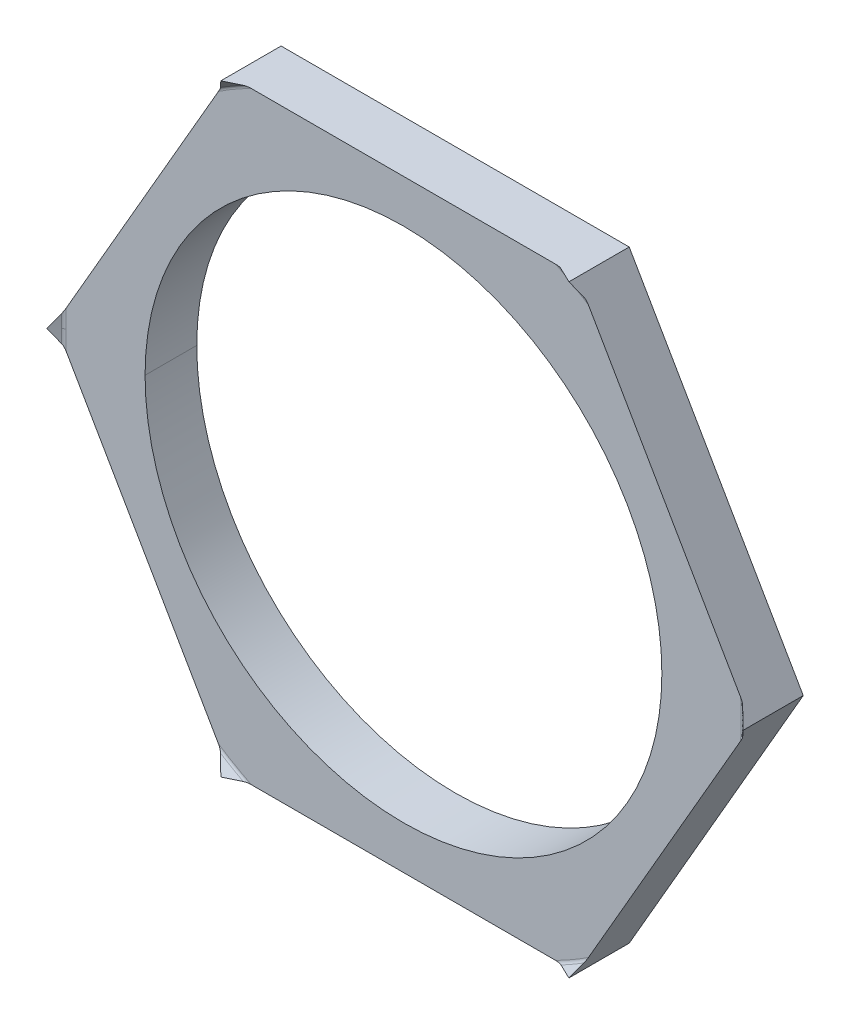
ISO-10303-21;
HEADER;
FILE_DESCRIPTION(('STEP AP214'),'2;1');
FILE_NAME('part.step','',(''),(''),'','','');
FILE_SCHEMA(('AUTOMOTIVE_DESIGN { 1 0 10303 214 1 1 1 1 }'));
ENDSEC;
DATA;
#1=APPLICATION_CONTEXT('core data for automotive mechanical design processes');
#2=APPLICATION_PROTOCOL_DEFINITION('international standard','automotive_design',2000,#1);
#3=PRODUCT_CONTEXT('',#1,'mechanical');
#4=PRODUCT('Part','Part','',(#3));
#5=PRODUCT_RELATED_PRODUCT_CATEGORY('part','',(#4));
#6=PRODUCT_DEFINITION_FORMATION('','',#4);
#7=PRODUCT_DEFINITION_CONTEXT('part definition',#1,'design');
#8=PRODUCT_DEFINITION('design','',#6,#7);
#9=PRODUCT_DEFINITION_SHAPE('','',#8);
#10=(LENGTH_UNIT() NAMED_UNIT(*) SI_UNIT(.MILLI.,.METRE.));
#11=(NAMED_UNIT(*) PLANE_ANGLE_UNIT() SI_UNIT($,.RADIAN.));
#12=(NAMED_UNIT(*) SI_UNIT($,.STERADIAN.) SOLID_ANGLE_UNIT());
#13=UNCERTAINTY_MEASURE_WITH_UNIT(LENGTH_MEASURE(1.E-05),#10,'distance_accuracy_value','');
#14=(GEOMETRIC_REPRESENTATION_CONTEXT(3) GLOBAL_UNCERTAINTY_ASSIGNED_CONTEXT((#13)) GLOBAL_UNIT_ASSIGNED_CONTEXT((#10,
#11,#12)) REPRESENTATION_CONTEXT('',''));
#15=CARTESIAN_POINT('',(0.,0.,0.));
#16=DIRECTION('',(0.,0.,1.));
#17=DIRECTION('',(1.,0.,0.));
#18=AXIS2_PLACEMENT_3D('',#15,#16,#17);
#19=CARTESIAN_POINT('',(39.2074120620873,0.,-8.));
#20=DIRECTION('',(0.,0.,1.));
#21=DIRECTION('',(0.,1.,0.));
#22=AXIS2_PLACEMENT_3D('',#19,#20,#21);
#23=PLANE('',#22);
#24=CARTESIAN_POINT('',(0.,0.,-8.));
#25=DIRECTION('',(0.,0.,-1.));
#26=DIRECTION('',(1.,0.,0.));
#27=AXIS2_PLACEMENT_3D('',#24,#25,#26);
#28=CIRCLE('',#27,30.);
#29=CARTESIAN_POINT('',(30.,0.,-8.));
#30=VERTEX_POINT('',#29);
#31=CARTESIAN_POINT('',(-30.,0.,-8.));
#32=VERTEX_POINT('',#31);
#33=EDGE_CURVE('E228',#30,#32,#28,.T.);
#34=ORIENTED_EDGE('',*,*,#33,.T.);
#35=CARTESIAN_POINT('',(0.,0.,-8.));
#36=DIRECTION('',(0.,0.,-1.));
#37=DIRECTION('',(1.,0.,0.));
#38=AXIS2_PLACEMENT_3D('',#35,#36,#37);
#39=CIRCLE('',#38,30.);
#40=EDGE_CURVE('E218',#32,#30,#39,.T.);
#41=ORIENTED_EDGE('',*,*,#40,.T.);
#42=EDGE_LOOP('',(#34,#41));
#43=FACE_BOUND('',#42,.T.);
#44=DIRECTION('',(0.5,-0.866025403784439,0.));
#45=VECTOR('',#44,1.);
#46=CARTESIAN_POINT('',(-40.4145188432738,0.,-8.));
#47=LINE('',#46,#45);
#48=CARTESIAN_POINT('',(-39.1457796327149,-2.19752077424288,-8.));
#49=VERTEX_POINT('',#48);
#50=CARTESIAN_POINT('',(-21.4759986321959,-32.8024792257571,-8.));
#51=VERTEX_POINT('',#50);
#52=EDGE_CURVE('E709',#49,#51,#47,.T.);
#53=ORIENTED_EDGE('',*,*,#52,.T.);
#54=CARTESIAN_POINT('',(0.,0.,-8.));
#55=DIRECTION('',(0.,0.,-1.));
#56=DIRECTION('',(-1.,0.,0.));
#57=AXIS2_PLACEMENT_3D('',#54,#55,#56);
#58=CIRCLE('',#57,39.2074120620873);
#59=CARTESIAN_POINT('',(-17.6697810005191,-35.,-8.));
#60=VERTEX_POINT('',#59);
#61=EDGE_CURVE('E604',#60,#51,#58,.T.);
#62=ORIENTED_EDGE('',*,*,#61,.F.);
#63=DIRECTION('',(1.,0.,0.));
#64=VECTOR('',#63,1.);
#65=CARTESIAN_POINT('',(-20.2072594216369,-35.,-8.));
#66=LINE('',#65,#64);
#67=CARTESIAN_POINT('',(17.6697810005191,-35.,-8.));
#68=VERTEX_POINT('',#67);
#69=EDGE_CURVE('E622',#60,#68,#66,.T.);
#70=ORIENTED_EDGE('',*,*,#69,.T.);
#71=CARTESIAN_POINT('',(0.,0.,-8.));
#72=DIRECTION('',(0.,0.,-1.));
#73=DIRECTION('',(-1.,0.,0.));
#74=AXIS2_PLACEMENT_3D('',#71,#72,#73);
#75=CIRCLE('',#74,39.2074120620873);
#76=CARTESIAN_POINT('',(21.4759986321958,-32.8024792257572,-8.));
#77=VERTEX_POINT('',#76);
#78=EDGE_CURVE('E563',#77,#68,#75,.T.);
#79=ORIENTED_EDGE('',*,*,#78,.F.);
#80=DIRECTION('',(0.5,0.866025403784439,0.));
#81=VECTOR('',#80,1.);
#82=CARTESIAN_POINT('',(20.2072594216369,-35.,-8.));
#83=LINE('',#82,#81);
#84=CARTESIAN_POINT('',(39.1457796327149,-2.19752077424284,-8.));
#85=VERTEX_POINT('',#84);
#86=EDGE_CURVE('E799',#77,#85,#83,.T.);
#87=ORIENTED_EDGE('',*,*,#86,.T.);
#88=CARTESIAN_POINT('',(0.,0.,-8.));
#89=DIRECTION('',(0.,0.,-1.));
#90=DIRECTION('',(-1.,0.,0.));
#91=AXIS2_PLACEMENT_3D('',#88,#89,#90);
#92=CIRCLE('',#91,39.2074120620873);
#93=CARTESIAN_POINT('',(39.1457796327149,2.19752077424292,-8.));
#94=VERTEX_POINT('',#93);
#95=EDGE_CURVE('E397',#94,#85,#92,.T.);
#96=ORIENTED_EDGE('',*,*,#95,.F.);
#97=DIRECTION('',(-0.5,0.866025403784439,0.));
#98=VECTOR('',#97,1.);
#99=CARTESIAN_POINT('',(40.4145188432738,0.,-8.));
#100=LINE('',#99,#98);
#101=CARTESIAN_POINT('',(21.4759986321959,32.8024792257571,-8.));
#102=VERTEX_POINT('',#101);
#103=EDGE_CURVE('E857',#94,#102,#100,.T.);
#104=ORIENTED_EDGE('',*,*,#103,.T.);
#105=CARTESIAN_POINT('',(0.,0.,-8.));
#106=DIRECTION('',(0.,0.,-1.));
#107=DIRECTION('',(-1.,0.,0.));
#108=AXIS2_PLACEMENT_3D('',#105,#106,#107);
#109=CIRCLE('',#108,39.2074120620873);
#110=CARTESIAN_POINT('',(17.669781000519,35.,-8.));
#111=VERTEX_POINT('',#110);
#112=EDGE_CURVE('E396',#111,#102,#109,.T.);
#113=ORIENTED_EDGE('',*,*,#112,.F.);
#114=DIRECTION('',(-1.,0.,0.));
#115=VECTOR('',#114,1.);
#116=CARTESIAN_POINT('',(20.2072594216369,35.,-8.));
#117=LINE('',#116,#115);
#118=CARTESIAN_POINT('',(-17.669781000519,35.,-8.));
#119=VERTEX_POINT('',#118);
#120=EDGE_CURVE('E415',#111,#119,#117,.T.);
#121=ORIENTED_EDGE('',*,*,#120,.T.);
#122=CARTESIAN_POINT('',(0.,0.,-8.));
#123=DIRECTION('',(0.,0.,-1.));
#124=DIRECTION('',(-1.,0.,0.));
#125=AXIS2_PLACEMENT_3D('',#122,#123,#124);
#126=CIRCLE('',#125,39.2074120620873);
#127=CARTESIAN_POINT('',(-21.4759986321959,32.8024792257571,-8.));
#128=VERTEX_POINT('',#127);
#129=EDGE_CURVE('E11',#128,#119,#126,.T.);
#130=ORIENTED_EDGE('',*,*,#129,.F.);
#131=DIRECTION('',(-0.5,-0.866025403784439,0.));
#132=VECTOR('',#131,1.);
#133=CARTESIAN_POINT('',(-20.2072594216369,35.,-8.));
#134=LINE('',#133,#132);
#135=CARTESIAN_POINT('',(-39.1457796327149,2.19752077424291,-8.));
#136=VERTEX_POINT('',#135);
#137=EDGE_CURVE('E452',#128,#136,#134,.T.);
#138=ORIENTED_EDGE('',*,*,#137,.T.);
#139=CARTESIAN_POINT('',(0.,0.,-8.));
#140=DIRECTION('',(0.,0.,-1.));
#141=DIRECTION('',(-1.,0.,0.));
#142=AXIS2_PLACEMENT_3D('',#139,#140,#141);
#143=CIRCLE('',#142,39.2074120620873);
#144=CARTESIAN_POINT('',(-39.2074120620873,0.,-8.));
#145=VERTEX_POINT('',#144);
#146=EDGE_CURVE('E239',#145,#136,#143,.T.);
#147=ORIENTED_EDGE('',*,*,#146,.F.);
#148=CARTESIAN_POINT('',(0.,0.,-8.));
#149=DIRECTION('',(0.,0.,-1.));
#150=DIRECTION('',(-1.,0.,0.));
#151=AXIS2_PLACEMENT_3D('',#148,#149,#150);
#152=CIRCLE('',#151,39.2074120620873);
#153=EDGE_CURVE('E605',#49,#145,#152,.T.);
#154=ORIENTED_EDGE('',*,*,#153,.F.);
#155=EDGE_LOOP('',(#53,#62,#70,#79,#87,#96,#104,#113,#121,#130,#138,#147,#154));
#156=FACE_BOUND('',#155,.T.);
#157=ADVANCED_FACE('F16',(#43,#156),#23,.T.);
#158=CARTESIAN_POINT('',(0.,0.,-7.));
#159=DIRECTION('',(0.,0.,1.));
#160=DIRECTION('',(1.,0.,0.));
#161=AXIS2_PLACEMENT_3D('',#158,#159,#160);
#162=CONICAL_SURFACE('',#161,40.4145188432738,0.785398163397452);
#163=CARTESIAN_POINT('',(-40.4145188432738,0.,-7.));
#164=CARTESIAN_POINT('',(-40.1218552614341,-0.506908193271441,-7.2926635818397));
#165=CARTESIAN_POINT('',(-39.827534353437,-1.01668695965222,-7.57745631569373));
#166=CARTESIAN_POINT('',(-39.5313824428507,-1.5296371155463,-7.85355339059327));
#167=(BOUNDED_CURVE() B_SPLINE_CURVE(3,(#163,#164,#165,#166),.UNSPECIFIED.,.F.,
.F.) B_SPLINE_CURVE_WITH_KNOTS((4,4),(0.0339504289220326,0.03591096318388),
.UNSPECIFIED.) CURVE() GEOMETRIC_REPRESENTATION_ITEM() RATIONAL_B_SPLINE_CURVE((1.,1.,1.,1.)) REPRESENTATION_ITEM(''));
#168=CARTESIAN_POINT('',(-40.4145188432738,0.,-7.));
#169=VERTEX_POINT('',#168);
#170=CARTESIAN_POINT('',(-39.5313824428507,-1.5296371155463,-7.85355339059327));
#171=VERTEX_POINT('',#170);
#172=EDGE_CURVE('E259',#169,#171,#167,.T.);
#173=ORIENTED_EDGE('',*,*,#172,.T.);
#174=CARTESIAN_POINT('',(0.,0.,-7.85355339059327));
#175=DIRECTION('',(0.,0.,-1.));
#176=DIRECTION('',(-1.,0.,0.));
#177=AXIS2_PLACEMENT_3D('',#174,#175,#176);
#178=CIRCLE('',#177,39.5609654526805);
#179=CARTESIAN_POINT('',(-39.5609654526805,0.,-7.85355339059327));
#180=VERTEX_POINT('',#179);
#181=EDGE_CURVE('E282',#171,#180,#178,.T.);
#182=ORIENTED_EDGE('',*,*,#181,.T.);
#183=CARTESIAN_POINT('',(0.,0.,-7.85355339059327));
#184=DIRECTION('',(0.,0.,-1.));
#185=DIRECTION('',(-1.,0.,0.));
#186=AXIS2_PLACEMENT_3D('',#183,#184,#185);
#187=CIRCLE('',#186,39.5609654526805);
#188=CARTESIAN_POINT('',(-39.5313824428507,1.52963711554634,-7.85355339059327));
#189=VERTEX_POINT('',#188);
#190=EDGE_CURVE('E253',#180,#189,#187,.T.);
#191=ORIENTED_EDGE('',*,*,#190,.T.);
#192=CARTESIAN_POINT('',(-39.5313824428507,1.52963711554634,-7.85355339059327));
#193=CARTESIAN_POINT('',(-39.828200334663,1.01553344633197,-7.57683543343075));
#194=CARTESIAN_POINT('',(-40.1224891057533,0.505810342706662,-7.29202973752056));
#195=CARTESIAN_POINT('',(-40.4145188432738,0.,-7.));
#196=(BOUNDED_CURVE() B_SPLINE_CURVE(3,(#192,#193,#194,#195),.UNSPECIFIED.,.F.,
.F.) B_SPLINE_CURVE_WITH_KNOTS((4,4),(0.0741404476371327,0.0761081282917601),
.UNSPECIFIED.) CURVE() GEOMETRIC_REPRESENTATION_ITEM() RATIONAL_B_SPLINE_CURVE((1.,1.,1.,1.)) REPRESENTATION_ITEM(''));
#197=EDGE_CURVE('E316',#189,#169,#196,.T.);
#198=ORIENTED_EDGE('',*,*,#197,.T.);
#199=EDGE_LOOP('',(#173,#182,#191,#198));
#200=FACE_BOUND('',#199,.T.);
#201=ADVANCED_FACE('F677',(#200),#162,.F.);
#202=CARTESIAN_POINT('',(0.,0.,-7.));
#203=DIRECTION('',(0.,0.,1.));
#204=DIRECTION('',(1.,0.,0.));
#205=AXIS2_PLACEMENT_3D('',#202,#203,#204);
#206=CONICAL_SURFACE('',#205,40.4145188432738,0.785398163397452);
#207=CARTESIAN_POINT('',(-18.4409866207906,35.,-7.85355339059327));
#208=CARTESIAN_POINT('',(-19.0335659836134,35.,-7.57732787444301));
#209=CARTESIAN_POINT('',(-19.6221954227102,35.,-7.29253199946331));
#210=CARTESIAN_POINT('',(-20.2072594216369,35.,-7.));
#211=(BOUNDED_CURVE() B_SPLINE_CURVE(3,(#207,#208,#209,#210),.UNSPECIFIED.,.F.,
.F.) B_SPLINE_CURVE_WITH_KNOTS((4,4),(0.0692713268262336,0.0712344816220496),
.UNSPECIFIED.) CURVE() GEOMETRIC_REPRESENTATION_ITEM() RATIONAL_B_SPLINE_CURVE((1.,1.,1.,1.)) REPRESENTATION_ITEM(''));
#212=CARTESIAN_POINT('',(-18.4409866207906,35.,-7.85355339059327));
#213=VERTEX_POINT('',#212);
#214=CARTESIAN_POINT('',(-20.2072594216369,35.,-7.));
#215=VERTEX_POINT('',#214);
#216=EDGE_CURVE('E312',#213,#215,#211,.T.);
#217=ORIENTED_EDGE('',*,*,#216,.T.);
#218=CARTESIAN_POINT('',(-20.2072594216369,35.,-7.));
#219=CARTESIAN_POINT('',(-20.4999230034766,34.4930918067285,-7.29266358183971));
#220=CARTESIAN_POINT('',(-20.7942439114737,33.9833130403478,-7.57745631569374));
#221=CARTESIAN_POINT('',(-21.09039582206,33.4703628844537,-7.85355339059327));
#222=(BOUNDED_CURVE() B_SPLINE_CURVE(3,(#218,#219,#220,#221),.UNSPECIFIED.,.F.,
.F.) B_SPLINE_CURVE_WITH_KNOTS((4,4),(0.0339504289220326,0.03591096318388),
.UNSPECIFIED.) CURVE() GEOMETRIC_REPRESENTATION_ITEM() RATIONAL_B_SPLINE_CURVE((1.,1.,1.,1.)) REPRESENTATION_ITEM(''));
#223=CARTESIAN_POINT('',(-21.09039582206,33.4703628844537,-7.85355339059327));
#224=VERTEX_POINT('',#223);
#225=EDGE_CURVE('E317',#215,#224,#222,.T.);
#226=ORIENTED_EDGE('',*,*,#225,.T.);
#227=CARTESIAN_POINT('',(0.,0.,-7.85355339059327));
#228=DIRECTION('',(0.,0.,-1.));
#229=DIRECTION('',(-1.,0.,0.));
#230=AXIS2_PLACEMENT_3D('',#227,#228,#229);
#231=CIRCLE('',#230,39.5609654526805);
#232=EDGE_CURVE('E25',#224,#213,#231,.T.);
#233=ORIENTED_EDGE('',*,*,#232,.T.);
#234=EDGE_LOOP('',(#217,#226,#233));
#235=FACE_BOUND('',#234,.T.);
#236=ADVANCED_FACE('F432',(#235),#206,.F.);
#237=CARTESIAN_POINT('',(0.,0.,-7.));
#238=DIRECTION('',(0.,0.,1.));
#239=DIRECTION('',(1.,0.,0.));
#240=AXIS2_PLACEMENT_3D('',#237,#238,#239);
#241=CONICAL_SURFACE('',#240,40.4145188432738,0.785398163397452);
#242=CARTESIAN_POINT('',(21.09039582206,33.4703628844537,-7.85355339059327));
#243=CARTESIAN_POINT('',(20.7935779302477,33.984466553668,-7.57683543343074));
#244=CARTESIAN_POINT('',(20.4992891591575,34.4941896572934,-7.29202973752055));
#245=CARTESIAN_POINT('',(20.2072594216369,35.,-7.));
#246=(BOUNDED_CURVE() B_SPLINE_CURVE(3,(#242,#243,#244,#245),.UNSPECIFIED.,.F.,
.F.) B_SPLINE_CURVE_WITH_KNOTS((4,4),(0.0741404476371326,0.0761081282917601),
.UNSPECIFIED.) CURVE() GEOMETRIC_REPRESENTATION_ITEM() RATIONAL_B_SPLINE_CURVE((1.,1.,1.,1.)) REPRESENTATION_ITEM(''));
#247=CARTESIAN_POINT('',(21.09039582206,33.4703628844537,-7.85355339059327));
#248=VERTEX_POINT('',#247);
#249=CARTESIAN_POINT('',(20.2072594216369,35.,-7.));
#250=VERTEX_POINT('',#249);
#251=EDGE_CURVE('E302',#248,#250,#246,.T.);
#252=ORIENTED_EDGE('',*,*,#251,.T.);
#253=CARTESIAN_POINT('',(20.2072594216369,35.,-7.));
#254=CARTESIAN_POINT('',(19.623352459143,35.,-7.291953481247));
#255=CARTESIAN_POINT('',(19.0347834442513,35.,-7.57676036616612));
#256=CARTESIAN_POINT('',(18.4409866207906,35.,-7.85355339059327));
#257=(BOUNDED_CURVE() B_SPLINE_CURVE(3,(#253,#254,#255,#256),.UNSPECIFIED.,.F.,
.F.) B_SPLINE_CURVE_WITH_KNOTS((4,4),(0.0291489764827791,0.0310946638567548),
.UNSPECIFIED.) CURVE() GEOMETRIC_REPRESENTATION_ITEM() RATIONAL_B_SPLINE_CURVE((1.,1.,1.,1.)) REPRESENTATION_ITEM(''));
#258=CARTESIAN_POINT('',(18.4409866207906,35.,-7.85355339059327));
#259=VERTEX_POINT('',#258);
#260=EDGE_CURVE('E308',#250,#259,#257,.T.);
#261=ORIENTED_EDGE('',*,*,#260,.T.);
#262=CARTESIAN_POINT('',(0.,0.,-7.85355339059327));
#263=DIRECTION('',(0.,0.,-1.));
#264=DIRECTION('',(-1.,0.,0.));
#265=AXIS2_PLACEMENT_3D('',#262,#263,#264);
#266=CIRCLE('',#265,39.5609654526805);
#267=EDGE_CURVE('E388',#259,#248,#266,.T.);
#268=ORIENTED_EDGE('',*,*,#267,.T.);
#269=EDGE_LOOP('',(#252,#261,#268));
#270=FACE_BOUND('',#269,.T.);
#271=ADVANCED_FACE('F685',(#270),#241,.F.);
#272=CARTESIAN_POINT('',(0.,0.,-7.));
#273=DIRECTION('',(0.,0.,1.));
#274=DIRECTION('',(1.,0.,0.));
#275=AXIS2_PLACEMENT_3D('',#272,#273,#274);
#276=CONICAL_SURFACE('',#275,40.4145188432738,0.785398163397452);
#277=DIRECTION('',(0.70710678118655,0.,0.707106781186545));
#278=VECTOR('',#277,1.);
#279=CARTESIAN_POINT('',(40.4145188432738,0.,-7.));
#280=LINE('',#279,#278);
#281=CARTESIAN_POINT('',(39.5609654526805,0.,-7.85355339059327));
#282=VERTEX_POINT('',#281);
#283=CARTESIAN_POINT('',(40.4145188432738,0.,-7.));
#284=VERTEX_POINT('',#283);
#285=EDGE_CURVE('E241',#282,#284,#280,.T.);
#286=ORIENTED_EDGE('',*,*,#285,.F.);
#287=CARTESIAN_POINT('',(0.,0.,-7.85355339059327));
#288=DIRECTION('',(0.,0.,-1.));
#289=DIRECTION('',(-1.,0.,0.));
#290=AXIS2_PLACEMENT_3D('',#287,#288,#289);
#291=CIRCLE('',#290,39.5609654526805);
#292=CARTESIAN_POINT('',(39.5313824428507,-1.52963711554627,-7.85355339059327));
#293=VERTEX_POINT('',#292);
#294=EDGE_CURVE('E556',#282,#293,#291,.T.);
#295=ORIENTED_EDGE('',*,*,#294,.T.);
#296=CARTESIAN_POINT('',(39.5313824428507,-1.52963711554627,-7.85355339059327));
#297=CARTESIAN_POINT('',(39.828200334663,-1.01553344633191,-7.57683543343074));
#298=CARTESIAN_POINT('',(40.1224891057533,-0.505810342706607,-7.29202973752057));
#299=CARTESIAN_POINT('',(40.4145188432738,0.,-7.));
#300=(BOUNDED_CURVE() B_SPLINE_CURVE(3,(#296,#297,#298,#299),.UNSPECIFIED.,.F.,
.F.) B_SPLINE_CURVE_WITH_KNOTS((4,4),(0.0741404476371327,0.0761081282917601),
.UNSPECIFIED.) CURVE() GEOMETRIC_REPRESENTATION_ITEM() RATIONAL_B_SPLINE_CURVE((1.,1.,1.,1.)) REPRESENTATION_ITEM(''));
#301=EDGE_CURVE('E292',#293,#284,#300,.T.);
#302=ORIENTED_EDGE('',*,*,#301,.T.);
#303=EDGE_LOOP('',(#286,#295,#302));
#304=FACE_BOUND('',#303,.T.);
#305=ADVANCED_FACE('F869',(#304),#276,.F.);
#306=CARTESIAN_POINT('',(0.,0.,-7.));
#307=DIRECTION('',(0.,0.,1.));
#308=DIRECTION('',(1.,0.,0.));
#309=AXIS2_PLACEMENT_3D('',#306,#307,#308);
#310=CONICAL_SURFACE('',#309,40.4145188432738,0.785398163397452);
#311=CARTESIAN_POINT('',(18.4409866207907,-35.,-7.85355339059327));
#312=CARTESIAN_POINT('',(19.0335659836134,-35.,-7.57732787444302));
#313=CARTESIAN_POINT('',(19.6221954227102,-35.,-7.29253199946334));
#314=CARTESIAN_POINT('',(20.2072594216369,-35.,-7.));
#315=(BOUNDED_CURVE() B_SPLINE_CURVE(3,(#311,#312,#313,#314),.UNSPECIFIED.,.F.,
.F.) B_SPLINE_CURVE_WITH_KNOTS((4,4),(0.0692713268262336,0.0712344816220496),
.UNSPECIFIED.) CURVE() GEOMETRIC_REPRESENTATION_ITEM() RATIONAL_B_SPLINE_CURVE((1.,1.,1.,1.)) REPRESENTATION_ITEM(''));
#316=CARTESIAN_POINT('',(18.4409866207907,-35.,-7.85355339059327));
#317=VERTEX_POINT('',#316);
#318=CARTESIAN_POINT('',(20.2072594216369,-35.,-7.));
#319=VERTEX_POINT('',#318);
#320=EDGE_CURVE('E279',#317,#319,#315,.T.);
#321=ORIENTED_EDGE('',*,*,#320,.T.);
#322=CARTESIAN_POINT('',(20.2072594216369,-35.,-7.));
#323=CARTESIAN_POINT('',(20.4999230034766,-34.4930918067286,-7.29266358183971));
#324=CARTESIAN_POINT('',(20.7942439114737,-33.9833130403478,-7.57745631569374));
#325=CARTESIAN_POINT('',(21.09039582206,-33.4703628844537,-7.85355339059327));
#326=(BOUNDED_CURVE() B_SPLINE_CURVE(3,(#322,#323,#324,#325),.UNSPECIFIED.,.F.,
.F.) B_SPLINE_CURVE_WITH_KNOTS((4,4),(0.0339504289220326,0.0359109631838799),
.UNSPECIFIED.) CURVE() GEOMETRIC_REPRESENTATION_ITEM() RATIONAL_B_SPLINE_CURVE((1.,1.,1.,1.)) REPRESENTATION_ITEM(''));
#327=CARTESIAN_POINT('',(21.09039582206,-33.4703628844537,-7.85355339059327));
#328=VERTEX_POINT('',#327);
#329=EDGE_CURVE('E288',#319,#328,#326,.T.);
#330=ORIENTED_EDGE('',*,*,#329,.T.);
#331=CARTESIAN_POINT('',(0.,0.,-7.85355339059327));
#332=DIRECTION('',(0.,0.,-1.));
#333=DIRECTION('',(-1.,0.,0.));
#334=AXIS2_PLACEMENT_3D('',#331,#332,#333);
#335=CIRCLE('',#334,39.5609654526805);
#336=EDGE_CURVE('E534',#328,#317,#335,.T.);
#337=ORIENTED_EDGE('',*,*,#336,.T.);
#338=EDGE_LOOP('',(#321,#330,#337));
#339=FACE_BOUND('',#338,.T.);
#340=ADVANCED_FACE('F785',(#339),#310,.F.);
#341=CARTESIAN_POINT('',(0.,0.,-7.));
#342=DIRECTION('',(0.,0.,1.));
#343=DIRECTION('',(1.,0.,0.));
#344=AXIS2_PLACEMENT_3D('',#341,#342,#343);
#345=CONICAL_SURFACE('',#344,40.4145188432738,0.785398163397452);
#346=CARTESIAN_POINT('',(-21.09039582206,-33.4703628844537,-7.85355339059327));
#347=CARTESIAN_POINT('',(-20.7935779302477,-33.984466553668,-7.57683543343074));
#348=CARTESIAN_POINT('',(-20.4992891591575,-34.4941896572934,-7.29202973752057));
#349=CARTESIAN_POINT('',(-20.2072594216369,-35.,-7.));
#350=(BOUNDED_CURVE() B_SPLINE_CURVE(3,(#346,#347,#348,#349),.UNSPECIFIED.,.F.,
.F.) B_SPLINE_CURVE_WITH_KNOTS((4,4),(0.0741404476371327,0.0761081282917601),
.UNSPECIFIED.) CURVE() GEOMETRIC_REPRESENTATION_ITEM() RATIONAL_B_SPLINE_CURVE((1.,1.,1.,1.)) REPRESENTATION_ITEM(''));
#351=CARTESIAN_POINT('',(-21.09039582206,-33.4703628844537,-7.85355339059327));
#352=VERTEX_POINT('',#351);
#353=CARTESIAN_POINT('',(-20.2072594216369,-35.,-7.));
#354=VERTEX_POINT('',#353);
#355=EDGE_CURVE('E268',#352,#354,#350,.T.);
#356=ORIENTED_EDGE('',*,*,#355,.T.);
#357=CARTESIAN_POINT('',(-20.2072594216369,-35.,-7.));
#358=CARTESIAN_POINT('',(-19.623352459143,-35.,-7.29195348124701));
#359=CARTESIAN_POINT('',(-19.0347834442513,-35.,-7.57676036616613));
#360=CARTESIAN_POINT('',(-18.4409866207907,-35.,-7.85355339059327));
#361=(BOUNDED_CURVE() B_SPLINE_CURVE(3,(#357,#358,#359,#360),.UNSPECIFIED.,.F.,
.F.) B_SPLINE_CURVE_WITH_KNOTS((4,4),(0.029148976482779,0.0310946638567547),
.UNSPECIFIED.) CURVE() GEOMETRIC_REPRESENTATION_ITEM() RATIONAL_B_SPLINE_CURVE((1.,1.,1.,1.)) REPRESENTATION_ITEM(''));
#362=CARTESIAN_POINT('',(-18.4409866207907,-35.,-7.85355339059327));
#363=VERTEX_POINT('',#362);
#364=EDGE_CURVE('E275',#354,#363,#361,.T.);
#365=ORIENTED_EDGE('',*,*,#364,.T.);
#366=CARTESIAN_POINT('',(0.,0.,-7.85355339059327));
#367=DIRECTION('',(0.,0.,-1.));
#368=DIRECTION('',(-1.,0.,0.));
#369=AXIS2_PLACEMENT_3D('',#366,#367,#368);
#370=CIRCLE('',#369,39.5609654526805);
#371=EDGE_CURVE('E596',#363,#352,#370,.T.);
#372=ORIENTED_EDGE('',*,*,#371,.T.);
#373=EDGE_LOOP('',(#356,#365,#372));
#374=FACE_BOUND('',#373,.T.);
#375=ADVANCED_FACE('F336',(#374),#345,.F.);
#376=CARTESIAN_POINT('',(0.,0.,-7.5));
#377=DIRECTION('',(0.,0.,-1.));
#378=DIRECTION('',(-1.,0.,0.));
#379=AXIS2_PLACEMENT_3D('',#376,#377,#378);
#380=TOROIDAL_SURFACE('',#379,39.2074120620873,0.5);
#381=CARTESIAN_POINT('',(-17.6697810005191,35.,-8.));
#382=CARTESIAN_POINT('',(-17.7089152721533,35.0000069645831,-7.99999648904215));
#383=CARTESIAN_POINT('',(-17.7480528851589,35.0000438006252,-7.99906614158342));
#384=CARTESIAN_POINT('',(-17.822015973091,35.0001045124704,-7.99548305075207));
#385=CARTESIAN_POINT('',(-17.8568511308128,35.0001293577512,-7.99302695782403));
#386=CARTESIAN_POINT('',(-17.9221595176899,35.000122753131,-7.98692338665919));
#387=CARTESIAN_POINT('',(-17.9526495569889,35.0000977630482,-7.98345644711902));
#388=CARTESIAN_POINT('',(-18.0092531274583,35.0000385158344,-7.97579664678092));
#389=CARTESIAN_POINT('',(-18.0353890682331,35.0000060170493,-7.97177036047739));
#390=CARTESIAN_POINT('',(-18.0804832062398,34.9999955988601,-7.96389217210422));
#391=CARTESIAN_POINT('',(-18.0994840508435,35.0000053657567,-7.96028382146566));
#392=CARTESIAN_POINT('',(-18.1365817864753,35.0000253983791,-7.9526438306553));
#393=CARTESIAN_POINT('',(-18.1546835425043,35.0000356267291,-7.94863589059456));
#394=CARTESIAN_POINT('',(-18.1899751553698,35.0000548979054,-7.94023634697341));
#395=CARTESIAN_POINT('',(-18.2071707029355,35.0000639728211,-7.93586870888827));
#396=CARTESIAN_POINT('',(-18.2406439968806,35.000075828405,-7.92679012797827));
#397=CARTESIAN_POINT('',(-18.2569282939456,35.0000788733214,-7.92210339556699));
#398=CARTESIAN_POINT('',(-18.2885746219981,35.0000779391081,-7.91242554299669));
#399=CARTESIAN_POINT('',(-18.303944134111,35.0000742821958,-7.90745895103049));
#400=CARTESIAN_POINT('',(-18.3337575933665,35.0000614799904,-7.89725886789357));
#401=CARTESIAN_POINT('',(-18.3482100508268,35.0000526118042,-7.89205030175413));
#402=CARTESIAN_POINT('',(-18.3761881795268,35.0000330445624,-7.88140303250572));
#403=CARTESIAN_POINT('',(-18.3897234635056,35.0000224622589,-7.87598970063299));
#404=CARTESIAN_POINT('',(-18.4158642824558,35.0000064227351,-7.86496534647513));
#405=CARTESIAN_POINT('',(-18.4284808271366,35.0000007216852,-7.85938038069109));
#406=CARTESIAN_POINT('',(-18.4409866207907,35.,-7.85355339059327));
#407=B_SPLINE_CURVE_WITH_KNOTS('',3,(#381,#382,#383,#384,#385,#386,#387,#388,#389,#390,#391,
#392,#393,#394,#395,#396,#397,#398,#399,#400,#401,#402,#403,#404,#405,#406),.UNSPECIFIED.,.F.,
.F.,(4,2,2,2,2,2,2,2,2,2,2,2,4),(0.,0.11739614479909,0.222126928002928,0.314160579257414,
0.39347319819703,0.451486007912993,0.507097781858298,0.560313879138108,0.611141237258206,
0.659588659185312,0.705667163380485,0.749390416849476,0.79077527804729),.UNSPECIFIED.);
#408=EDGE_CURVE('E358',#119,#213,#407,.T.);
#409=ORIENTED_EDGE('',*,*,#408,.T.);
#410=ORIENTED_EDGE('',*,*,#232,.F.);
#411=CARTESIAN_POINT('',(-21.0903958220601,33.4703628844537,-7.85355339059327));
#412=CARTESIAN_POINT('',(-21.0966300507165,33.4595663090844,-7.85936243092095));
#413=CARTESIAN_POINT('',(-21.1029236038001,33.4486768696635,-7.86493092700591));
#414=CARTESIAN_POINT('',(-21.1159657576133,33.4261190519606,-7.8759231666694));
#415=CARTESIAN_POINT('',(-21.1227200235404,33.4144413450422,-7.88132109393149));
#416=CARTESIAN_POINT('',(-21.1366781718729,33.3903040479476,-7.89193869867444));
#417=CARTESIAN_POINT('',(-21.1438867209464,33.3778361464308,-7.89713323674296));
#418=CARTESIAN_POINT('',(-21.1587510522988,33.3521159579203,-7.90730677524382));
#419=CARTESIAN_POINT('',(-21.1664108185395,33.3388562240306,-7.91226107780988));
#420=CARTESIAN_POINT('',(-21.1821757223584,33.3115527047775,-7.92191623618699));
#421=CARTESIAN_POINT('',(-21.1902842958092,33.2975023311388,-7.92659278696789));
#422=CARTESIAN_POINT('',(-21.2069460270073,33.2686200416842,-7.93565328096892));
#423=CARTESIAN_POINT('',(-21.2155022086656,33.2537823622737,-7.94001323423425));
#424=CARTESIAN_POINT('',(-21.2330610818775,33.2233313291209,-7.9484000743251));
#425=CARTESIAN_POINT('',(-21.2420665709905,33.2077130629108,-7.95240321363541));
#426=CARTESIAN_POINT('',(-21.2605221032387,33.1757069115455,-7.96003671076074));
#427=CARTESIAN_POINT('',(-21.2699745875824,33.159314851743,-7.96364358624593));
#428=CARTESIAN_POINT('',(-21.2925285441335,33.1202704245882,-7.97155469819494));
#429=CARTESIAN_POINT('',(-21.3056629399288,33.0975864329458,-7.97560962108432));
#430=CARTESIAN_POINT('',(-21.3341066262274,33.0484402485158,-7.98332606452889));
#431=CARTESIAN_POINT('',(-21.3494257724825,33.021957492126,-7.98681926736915));
#432=CARTESIAN_POINT('',(-21.3822041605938,32.9651974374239,-7.99297052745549));
#433=CARTESIAN_POINT('',(-21.3996662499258,32.9349020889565,-7.995446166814));
#434=CARTESIAN_POINT('',(-21.4367409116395,32.8705642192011,-7.99905847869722));
#435=CARTESIAN_POINT('',(-21.4563575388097,32.8365126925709,-7.99999643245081));
#436=CARTESIAN_POINT('',(-21.4759986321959,32.8024792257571,-8.));
#437=B_SPLINE_CURVE_WITH_KNOTS('',3,(#411,#412,#413,#414,#415,#416,#417,#418,#419,#420,#421,
#422,#423,#424,#425,#426,#427,#428,#429,#430,#431,#432,#433,#434,#435,#436),.UNSPECIFIED.,.F.,
.F.,(4,2,2,2,2,2,2,2,2,2,2,2,4),(0.,0.0412572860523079,0.0848382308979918,0.130759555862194,
0.17903482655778,0.229674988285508,0.282688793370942,0.338083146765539,0.395863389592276,
0.475414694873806,0.567767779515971,0.672898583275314,0.790775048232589),.UNSPECIFIED.);
#438=EDGE_CURVE('E219',#224,#128,#437,.T.);
#439=ORIENTED_EDGE('',*,*,#438,.T.);
#440=ORIENTED_EDGE('',*,*,#129,.T.);
#441=EDGE_LOOP('',(#409,#410,#439,#440));
#442=FACE_BOUND('',#441,.T.);
#443=ADVANCED_FACE('F325',(#442),#380,.F.);
#444=CARTESIAN_POINT('',(0.,0.,-7.5));
#445=DIRECTION('',(0.,0.,-1.));
#446=DIRECTION('',(-1.,0.,0.));
#447=AXIS2_PLACEMENT_3D('',#444,#445,#446);
#448=TOROIDAL_SURFACE('',#447,39.2074120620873,0.5);
#449=CARTESIAN_POINT('',(21.4759986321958,32.8024792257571,-8.));
#450=CARTESIAN_POINT('',(21.4564619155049,32.8363316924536,-7.99999650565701));
#451=CARTESIAN_POINT('',(21.4369493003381,32.8702019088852,-7.99906847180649));
#452=CARTESIAN_POINT('',(21.4000652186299,32.9342079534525,-7.99549432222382));
#453=CARTESIAN_POINT('',(21.3826897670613,32.9643526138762,-7.99304427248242));
#454=CARTESIAN_POINT('',(21.3500674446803,33.0208429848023,-7.98695559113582));
#455=CARTESIAN_POINT('',(21.3348177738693,33.0472064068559,-7.98349696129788));
#456=CARTESIAN_POINT('',(21.3064948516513,33.0961451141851,-7.97585530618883));
#457=CARTESIAN_POINT('',(21.2934119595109,33.1187405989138,-7.97183835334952));
#458=CARTESIAN_POINT('',(21.2708560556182,33.1577878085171,-7.96397082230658));
#459=CARTESIAN_POINT('',(21.261351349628,33.1742700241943,-7.96036188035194));
#460=CARTESIAN_POINT('',(21.2427953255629,33.206450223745,-7.95271958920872));
#461=CARTESIAN_POINT('',(21.2337415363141,33.2221524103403,-7.94871001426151));
#462=CARTESIAN_POINT('',(21.2160898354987,33.2527647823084,-7.94030623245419));
#463=CARTESIAN_POINT('',(21.2074891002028,33.2676799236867,-7.93593606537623));
#464=CARTESIAN_POINT('',(21.1907420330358,33.2967105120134,-7.92685159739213));
#465=CARTESIAN_POINT('',(21.1825926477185,33.3108317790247,-7.92216158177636));
#466=CARTESIAN_POINT('',(21.1667498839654,33.3382703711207,-7.91247646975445));
#467=CARTESIAN_POINT('',(21.1590530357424,33.3515943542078,-7.90750597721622));
#468=CARTESIAN_POINT('',(21.1441183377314,33.3774362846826,-7.89729752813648));
#469=CARTESIAN_POINT('',(21.1368764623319,33.389961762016,-7.89208457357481));
#470=CARTESIAN_POINT('',(21.122855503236,33.4142074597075,-7.88142808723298));
#471=CARTESIAN_POINT('',(21.1160717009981,33.4259360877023,-7.87601000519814));
#472=CARTESIAN_POINT('',(21.1029744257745,33.448589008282,-7.86497581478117));
#473=CARTESIAN_POINT('',(21.096655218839,33.4595227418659,-7.85938584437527));
#474=CARTESIAN_POINT('',(21.0903958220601,33.4703628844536,-7.85355339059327));
#475=B_SPLINE_CURVE_WITH_KNOTS('',3,(#449,#450,#451,#452,#453,#454,#455,#456,#457,#458,#459,
#460,#461,#462,#463,#464,#465,#466,#467,#468,#469,#470,#471,#472,#473,#474),.UNSPECIFIED.,.F.,
.F.,(4,2,2,2,2,2,2,2,2,2,2,2,4),(0.,0.117249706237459,0.221855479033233,0.313785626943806,
0.393016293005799,0.451104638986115,0.506786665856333,0.560067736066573,0.610954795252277,
0.659456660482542,0.705584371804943,0.749351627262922,0.79077532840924),.UNSPECIFIED.);
#476=EDGE_CURVE('E495',#102,#248,#475,.T.);
#477=ORIENTED_EDGE('',*,*,#476,.T.);
#478=ORIENTED_EDGE('',*,*,#267,.F.);
#479=CARTESIAN_POINT('',(18.4409866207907,35.,-7.85355339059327));
#480=CARTESIAN_POINT('',(18.4285175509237,35.0000007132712,-7.85936329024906));
#481=CARTESIAN_POINT('',(18.4159383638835,35.0000063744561,-7.86493257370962));
#482=CARTESIAN_POINT('',(18.3898775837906,35.0000223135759,-7.8759263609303));
#483=CARTESIAN_POINT('',(18.3763850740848,35.0000328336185,-7.8813250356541));
#484=CARTESIAN_POINT('',(18.3484978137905,35.0000523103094,-7.89194409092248));
#485=CARTESIAN_POINT('',(18.3340935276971,35.0000611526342,-7.89713931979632));
#486=CARTESIAN_POINT('',(18.3043817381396,35.0000739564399,-7.90731417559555));
#487=CARTESIAN_POINT('',(18.289065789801,35.000077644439,-7.91226909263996));
#488=CARTESIAN_POINT('',(18.2575318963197,35.0000786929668,-7.92192539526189));
#489=CARTESIAN_POINT('',(18.2413065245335,35.0000757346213,-7.92660246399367));
#490=CARTESIAN_POINT('',(18.2079563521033,35.000064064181,-7.93566388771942));
#491=CARTESIAN_POINT('',(18.1908250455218,35.00005508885,-7.94002424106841));
#492=CARTESIAN_POINT('',(18.155667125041,35.0000359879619,-7.94841175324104));
#493=CARTESIAN_POINT('',(18.1376348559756,35.00002582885,-7.95241515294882));
#494=CARTESIAN_POINT('',(18.1006812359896,35.0000057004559,-7.96004901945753));
#495=CARTESIAN_POINT('',(18.0817550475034,34.9999957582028,-7.96365599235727));
#496=CARTESIAN_POINT('',(18.0366646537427,35.0000058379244,-7.97156542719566));
#497=CARTESIAN_POINT('',(18.0104566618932,35.0000385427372,-7.97561887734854));
#498=CARTESIAN_POINT('',(17.9536823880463,35.000098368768,-7.9833324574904));
#499=CARTESIAN_POINT('',(17.923093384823,35.0001237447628,-7.98682434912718));
#500=CARTESIAN_POINT('',(17.8575603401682,35.0001306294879,-7.99297325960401));
#501=CARTESIAN_POINT('',(17.8225992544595,35.0001055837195,-7.99544794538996));
#502=CARTESIAN_POINT('',(17.7483578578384,35.0000442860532,-7.99905884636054));
#503=CARTESIAN_POINT('',(17.7090677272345,35.0000070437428,-7.99999643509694));
#504=CARTESIAN_POINT('',(17.669781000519,35.,-8.));
#505=B_SPLINE_CURVE_WITH_KNOTS('',3,(#479,#480,#481,#482,#483,#484,#485,#486,#487,#488,#489,
#490,#491,#492,#493,#494,#495,#496,#497,#498,#499,#500,#501,#502,#503,#504),.UNSPECIFIED.,.F.,
.F.,(4,2,2,2,2,2,2,2,2,2,2,2,4),(0.,0.0412633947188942,0.0848512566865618,0.130780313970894,
0.179064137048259,0.229713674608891,0.282737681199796,0.338143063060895,0.395935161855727,
0.475473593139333,0.567810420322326,0.672921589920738,0.790775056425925),.UNSPECIFIED.);
#506=EDGE_CURVE('E417',#259,#111,#505,.T.);
#507=ORIENTED_EDGE('',*,*,#506,.T.);
#508=ORIENTED_EDGE('',*,*,#112,.T.);
#509=EDGE_LOOP('',(#477,#478,#507,#508));
#510=FACE_BOUND('',#509,.T.);
#511=ADVANCED_FACE('F335',(#510),#448,.F.);
#512=CARTESIAN_POINT('',(0.,0.,-7.5));
#513=DIRECTION('',(0.,0.,-1.));
#514=DIRECTION('',(-1.,0.,0.));
#515=AXIS2_PLACEMENT_3D('',#512,#513,#514);
#516=TOROIDAL_SURFACE('',#515,39.2074120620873,0.5);
#517=CARTESIAN_POINT('',(39.1457796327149,-2.19752077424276,-8.));
#518=CARTESIAN_POINT('',(39.1653283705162,-2.16367524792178,-7.999996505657));
#519=CARTESIAN_POINT('',(39.1849045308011,-2.12984171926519,-7.99906847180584));
#520=CARTESIAN_POINT('',(39.2218933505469,-2.06589614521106,-7.99549432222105));
#521=CARTESIAN_POINT('',(39.23931166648,-2.03577623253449,-7.99304427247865));
#522=CARTESIAN_POINT('',(39.2719226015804,-1.97927928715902,-7.98695559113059));
#523=CARTESIAN_POINT('',(39.2871291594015,-1.95289097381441,-7.98349696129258));
#524=CARTESIAN_POINT('',(39.315349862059,-1.90389325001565,-7.97585530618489));
#525=CARTESIAN_POINT('',(39.3283766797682,-1.88126539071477,-7.97183835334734));
#526=CARTESIAN_POINT('',(39.350914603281,-1.84220780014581,-7.96397082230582));
#527=CARTESIAN_POINT('',(39.3604362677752,-1.82573537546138,-7.96036188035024));
#528=CARTESIAN_POINT('',(39.3790271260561,-1.79357528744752,-7.95271958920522));
#529=CARTESIAN_POINT('',(39.3880987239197,-1.77788338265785,-7.94871001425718));
#530=CARTESIAN_POINT('',(39.4057839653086,-1.74729037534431,-7.94030623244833));
#531=CARTESIAN_POINT('',(39.414400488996,-1.73238434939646,-7.9359360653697));
#532=CARTESIAN_POINT('',(39.4311681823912,-1.70336566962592,-7.92685159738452));
#533=CARTESIAN_POINT('',(39.4393228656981,-1.68924746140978,-7.92216158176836));
#534=CARTESIAN_POINT('',(39.4551640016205,-1.66180792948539,-7.91247646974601));
#535=CARTESIAN_POINT('',(39.4628544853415,-1.64848027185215,-7.90750597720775));
#536=CARTESIAN_POINT('',(39.4777669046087,-1.62262547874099,-7.89729752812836));
#537=CARTESIAN_POINT('',(39.4849933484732,-1.61009109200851,-7.89208457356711));
#538=CARTESIAN_POINT('',(39.4989802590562,-1.58582573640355,-7.88142808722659));
#539=CARTESIAN_POINT('',(39.5057456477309,-1.57408647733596,-7.87601000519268));
#540=CARTESIAN_POINT('',(39.5188150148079,-1.55141744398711,-7.8649758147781));
#541=CARTESIAN_POINT('',(39.5251243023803,-1.54047798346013,-7.85938584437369));
#542=CARTESIAN_POINT('',(39.5313824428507,-1.52963711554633,-7.85355339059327));
#543=B_SPLINE_CURVE_WITH_KNOTS('',3,(#517,#518,#519,#520,#521,#522,#523,#524,#525,#526,#527,
#528,#529,#530,#531,#532,#533,#534,#535,#536,#537,#538,#539,#540,#541,#542),.UNSPECIFIED.,.F.,
.F.,(4,2,2,2,2,2,2,2,2,2,2,2,4),(0.,0.11724970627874,0.221855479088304,0.31378562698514,
0.393016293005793,0.451104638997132,0.506786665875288,0.560067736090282,0.610954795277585,
0.659456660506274,0.705584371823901,0.749351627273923,0.790775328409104),.UNSPECIFIED.);
#544=EDGE_CURVE('E568',#85,#293,#543,.T.);
#545=ORIENTED_EDGE('',*,*,#544,.T.);
#546=ORIENTED_EDGE('',*,*,#294,.F.);
#547=CARTESIAN_POINT('',(0.,0.,-7.85355339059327));
#548=DIRECTION('',(0.,0.,-1.));
#549=DIRECTION('',(-1.,0.,0.));
#550=AXIS2_PLACEMENT_3D('',#547,#548,#549);
#551=CIRCLE('',#550,39.5609654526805);
#552=CARTESIAN_POINT('',(39.5313824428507,1.52963711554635,-7.85355339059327));
#553=VERTEX_POINT('',#552);
#554=EDGE_CURVE('E246',#553,#282,#551,.T.);
#555=ORIENTED_EDGE('',*,*,#554,.F.);
#556=CARTESIAN_POINT('',(39.5313824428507,1.52963711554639,-7.85355339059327));
#557=CARTESIAN_POINT('',(39.525149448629,1.54043440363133,-7.85936243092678));
#558=CARTESIAN_POINT('',(39.5188656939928,1.55132950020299,-7.86493092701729));
#559=CARTESIAN_POINT('',(39.505851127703,1.57390324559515,-7.87592316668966));
#560=CARTESIAN_POINT('',(39.4991150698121,1.58559146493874,-7.88132109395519));
#561=CARTESIAN_POINT('',(39.485190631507,1.60974822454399,-7.89193869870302));
#562=CARTESIAN_POINT('',(39.4779973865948,1.62222496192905,-7.89713323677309));
#563=CARTESIAN_POINT('',(39.4631552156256,1.64795794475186,-7.90730677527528));
#564=CARTESIAN_POINT('',(39.4555018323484,1.66122136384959,-7.91226107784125));
#565=CARTESIAN_POINT('',(39.4397387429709,1.68852593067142,-7.92191623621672));
#566=CARTESIAN_POINT('',(39.4316250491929,1.70257334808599,-7.92659278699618));
#567=CARTESIAN_POINT('',(39.4149431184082,1.73144397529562,-7.9356532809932));
#568=CARTESIAN_POINT('',(39.4063714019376,1.74627268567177,-7.94001323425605));
#569=CARTESIAN_POINT('',(39.3887794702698,1.77670463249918,-7.94840007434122));
#570=CARTESIAN_POINT('',(39.3797563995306,1.79231274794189,-7.95240321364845));
#571=CARTESIAN_POINT('',(39.3612660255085,1.8242987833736,-7.96003671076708));
#572=CARTESIAN_POINT('',(39.3517963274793,1.84068090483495,-7.96364358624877));
#573=CARTESIAN_POINT('',(39.3292598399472,1.87973541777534,-7.97155469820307));
#574=CARTESIAN_POINT('',(39.3161821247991,1.90245213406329,-7.97560962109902));
#575=CARTESIAN_POINT('',(39.2878421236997,1.95165818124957,-7.98332606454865));
#576=CARTESIAN_POINT('',(39.2725669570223,1.97816632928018,-7.98681926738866));
#577=CARTESIAN_POINT('',(39.2398005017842,2.03493327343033,-7.99297052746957));
#578=CARTESIAN_POINT('',(39.2222950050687,2.06520356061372,-7.99544616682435));
#579=CARTESIAN_POINT('',(39.1851141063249,2.12948009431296,-7.99905847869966));
#580=CARTESIAN_POINT('',(39.1654329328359,2.16349435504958,-7.99999643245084));
#581=CARTESIAN_POINT('',(39.1457796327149,2.19752077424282,-8.));
#582=B_SPLINE_CURVE_WITH_KNOTS('',3,(#556,#557,#558,#559,#560,#561,#562,#563,#564,#565,#566,
#567,#568,#569,#570,#571,#572,#573,#574,#575,#576,#577,#578,#579,#580,#581),.UNSPECIFIED.,.F.,
.F.,(4,2,2,2,2,2,2,2,2,2,2,2,4),(0.,0.0412572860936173,0.0848382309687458,0.130759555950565,
0.179034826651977,0.229674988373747,0.28268879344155,0.338083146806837,0.395863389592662,
0.475414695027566,0.567767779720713,0.672898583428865,0.790775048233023),.UNSPECIFIED.);
#583=EDGE_CURVE('E403',#553,#94,#582,.T.);
#584=ORIENTED_EDGE('',*,*,#583,.T.);
#585=ORIENTED_EDGE('',*,*,#95,.T.);
#586=EDGE_LOOP('',(#545,#546,#555,#584,#585));
#587=FACE_BOUND('',#586,.T.);
#588=ADVANCED_FACE('F470',(#587),#516,.F.);
#589=CARTESIAN_POINT('',(0.,0.,-7.5));
#590=DIRECTION('',(0.,0.,-1.));
#591=DIRECTION('',(-1.,0.,0.));
#592=AXIS2_PLACEMENT_3D('',#589,#590,#591);
#593=TOROIDAL_SURFACE('',#592,39.2074120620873,0.5);
#594=CARTESIAN_POINT('',(17.6697810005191,-35.,-8.));
#595=CARTESIAN_POINT('',(17.709096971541,-35.0000070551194,-7.99999642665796));
#596=CARTESIAN_POINT('',(17.7484163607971,-35.0000444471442,-7.99905744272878));
#597=CARTESIAN_POINT('',(17.8227151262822,-35.0001060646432,-7.9954409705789));
#598=CARTESIAN_POINT('',(17.8577043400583,-35.0001312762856,-7.992962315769));
#599=CARTESIAN_POINT('',(17.9232923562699,-35.000124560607,-7.98680315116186));
#600=CARTESIAN_POINT('',(17.9539082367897,-35.0000992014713,-7.98330518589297));
#601=CARTESIAN_POINT('',(18.0107349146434,-35.0000390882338,-7.97557763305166));
#602=CARTESIAN_POINT('',(18.0369684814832,-35.0000061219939,-7.97151649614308));
#603=CARTESIAN_POINT('',(18.0820637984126,-34.9999955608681,-7.96359858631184));
#604=CARTESIAN_POINT('',(18.1009696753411,-35.0000052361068,-7.95999250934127));
#605=CARTESIAN_POINT('',(18.13788455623,-35.0000249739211,-7.95236120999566));
#606=CARTESIAN_POINT('',(18.1558983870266,-35.0000350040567,-7.94835941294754));
#607=CARTESIAN_POINT('',(18.1910213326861,-35.0000539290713,-7.93997574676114));
#608=CARTESIAN_POINT('',(18.2081360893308,-35.0000628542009,-7.93561756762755));
#609=CARTESIAN_POINT('',(18.2414550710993,-35.000074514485,-7.92656097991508));
#610=CARTESIAN_POINT('',(18.2576657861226,-35.0000775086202,-7.92188650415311));
#611=CARTESIAN_POINT('',(18.2891722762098,-35.0000765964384,-7.91223573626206));
#612=CARTESIAN_POINT('',(18.3044754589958,-35.0000730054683,-7.90728369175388));
#613=CARTESIAN_POINT('',(18.3341636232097,-35.0000604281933,-7.89711479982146));
#614=CARTESIAN_POINT('',(18.3485570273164,-35.000051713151,-7.89192259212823));
#615=CARTESIAN_POINT('',(18.3764244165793,-35.0000324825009,-7.88130967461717));
#616=CARTESIAN_POINT('',(18.3899079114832,-35.0000220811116,-7.87591404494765));
#617=CARTESIAN_POINT('',(18.4159525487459,-35.0000063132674,-7.86492634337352));
#618=CARTESIAN_POINT('',(18.4285245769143,-35.0000007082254,-7.85936002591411));
#619=CARTESIAN_POINT('',(18.4409866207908,-35.,-7.85355339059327));
#620=B_SPLINE_CURVE_WITH_KNOTS('',3,(#594,#595,#596,#597,#598,#599,#600,#601,#602,#603,#604,
#605,#606,#607,#608,#609,#610,#611,#612,#613,#614,#615,#616,#617,#618,#619),.UNSPECIFIED.,.F.,
.F.,(4,2,2,2,2,2,2,2,2,2,2,2,4),(0.,0.117941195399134,0.22313729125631,0.315556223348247,
0.395173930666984,0.452905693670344,0.508256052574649,0.561230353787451,0.611835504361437,
0.660080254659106,0.705975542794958,0.749534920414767,0.790775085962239),.UNSPECIFIED.);
#621=EDGE_CURVE('E626',#68,#317,#620,.T.);
#622=ORIENTED_EDGE('',*,*,#621,.T.);
#623=ORIENTED_EDGE('',*,*,#336,.F.);
#624=CARTESIAN_POINT('',(21.09039582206,-33.4703628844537,-7.85355339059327));
#625=CARTESIAN_POINT('',(21.0966300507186,-33.4595663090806,-7.85936243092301));
#626=CARTESIAN_POINT('',(21.1029236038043,-33.4486768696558,-7.86493092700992));
#627=CARTESIAN_POINT('',(21.1159657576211,-33.4261190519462,-7.87592316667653));
#628=CARTESIAN_POINT('',(21.1227200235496,-33.4144413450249,-7.88132109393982));
#629=CARTESIAN_POINT('',(21.1366781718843,-33.3903040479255,-7.89193869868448));
#630=CARTESIAN_POINT('',(21.1438867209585,-33.3778361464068,-7.89713323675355));
#631=CARTESIAN_POINT('',(21.1587510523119,-33.3521159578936,-7.90730677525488));
#632=CARTESIAN_POINT('',(21.1664108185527,-33.3388562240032,-7.9122610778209));
#633=CARTESIAN_POINT('',(21.1821757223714,-33.3115527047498,-7.92191623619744));
#634=CARTESIAN_POINT('',(21.1902842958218,-33.2975023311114,-7.92659278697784));
#635=CARTESIAN_POINT('',(21.2069460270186,-33.268620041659,-7.93565328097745));
#636=CARTESIAN_POINT('',(21.215502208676,-33.2537823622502,-7.94001323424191));
#637=CARTESIAN_POINT('',(21.2330610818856,-33.223331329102,-7.94840007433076));
#638=CARTESIAN_POINT('',(21.2420665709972,-33.2077130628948,-7.95240321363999));
#639=CARTESIAN_POINT('',(21.2605221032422,-33.1757069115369,-7.96003671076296));
#640=CARTESIAN_POINT('',(21.2699745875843,-33.1593148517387,-7.96364358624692));
#641=CARTESIAN_POINT('',(21.2925285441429,-33.1202704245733,-7.97155469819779));
#642=CARTESIAN_POINT('',(21.3056629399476,-33.0975864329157,-7.97560962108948));
#643=CARTESIAN_POINT('',(21.3341066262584,-33.0484402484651,-7.98332606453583));
#644=CARTESIAN_POINT('',(21.3494257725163,-33.02195749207,-7.986819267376));
#645=CARTESIAN_POINT('',(21.3822041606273,-32.9651974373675,-7.99297052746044));
#646=CARTESIAN_POINT('',(21.3996662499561,-32.9349020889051,-7.99544616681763));
#647=CARTESIAN_POINT('',(21.4367409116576,-32.8705642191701,-7.99905847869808));
#648=CARTESIAN_POINT('',(21.4563575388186,-32.8365126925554,-7.99999643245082));
#649=CARTESIAN_POINT('',(21.4759986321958,-32.8024792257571,-8.));
#650=B_SPLINE_CURVE_WITH_KNOTS('',3,(#624,#625,#626,#627,#628,#629,#630,#631,#632,#633,#634,
#635,#636,#637,#638,#639,#640,#641,#642,#643,#644,#645,#646,#647,#648,#649),.UNSPECIFIED.,.F.,
.F.,(4,2,2,2,2,2,2,2,2,2,2,2,4),(0.,0.0412572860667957,0.0848382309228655,0.130759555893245,
0.179034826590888,0.229674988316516,0.282688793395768,0.338083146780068,0.395863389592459,
0.475414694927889,0.567767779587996,0.672898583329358,0.790775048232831),.UNSPECIFIED.);
#651=EDGE_CURVE('E298',#328,#77,#650,.T.);
#652=ORIENTED_EDGE('',*,*,#651,.T.);
#653=ORIENTED_EDGE('',*,*,#78,.T.);
#654=EDGE_LOOP('',(#622,#623,#652,#653));
#655=FACE_BOUND('',#654,.T.);
#656=ADVANCED_FACE('F474',(#655),#593,.F.);
#657=CARTESIAN_POINT('',(0.,0.,-7.5));
#658=DIRECTION('',(0.,0.,-1.));
#659=DIRECTION('',(-1.,0.,0.));
#660=AXIS2_PLACEMENT_3D('',#657,#658,#659);
#661=TOROIDAL_SURFACE('',#660,39.2074120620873,0.5);
#662=CARTESIAN_POINT('',(-21.4759986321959,-32.8024792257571,-8.));
#663=CARTESIAN_POINT('',(-21.4564619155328,-32.8363316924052,-7.99999650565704));
#664=CARTESIAN_POINT('',(-21.4369493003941,-32.8702019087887,-7.99906847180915));
#665=CARTESIAN_POINT('',(-21.4000652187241,-32.9342079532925,-7.99549432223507));
#666=CARTESIAN_POINT('',(-21.3826897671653,-32.9643526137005,-7.99304427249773));
#667=CARTESIAN_POINT('',(-21.3500674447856,-33.0208429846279,-7.98695559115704));
#668=CARTESIAN_POINT('',(-21.3348177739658,-33.0472064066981,-7.98349696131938));
#669=CARTESIAN_POINT('',(-21.3064948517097,-33.0961451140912,-7.97585530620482));
#670=CARTESIAN_POINT('',(-21.2934119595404,-33.1187405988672,-7.97183835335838));
#671=CARTESIAN_POINT('',(-21.2708560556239,-33.1577878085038,-7.96397082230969));
#672=CARTESIAN_POINT('',(-21.261351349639,-33.1742700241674,-7.96036188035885));
#673=CARTESIAN_POINT('',(-21.2427953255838,-33.2064502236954,-7.95271958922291));
#674=CARTESIAN_POINT('',(-21.2337415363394,-33.2221524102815,-7.94871001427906));
#675=CARTESIAN_POINT('',(-21.2160898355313,-33.2527647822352,-7.94030623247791));
#676=CARTESIAN_POINT('',(-21.2074891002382,-33.2676799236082,-7.93593606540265));
#677=CARTESIAN_POINT('',(-21.1907420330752,-33.2967105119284,-7.92685159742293));
#678=CARTESIAN_POINT('',(-21.1825926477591,-33.3108317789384,-7.92216158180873));
#679=CARTESIAN_POINT('',(-21.1667498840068,-33.3382703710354,-7.91247646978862));
#680=CARTESIAN_POINT('',(-21.1590530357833,-33.3515943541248,-7.9075059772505));
#681=CARTESIAN_POINT('',(-21.1441183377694,-33.3774362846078,-7.89729752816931));
#682=CARTESIAN_POINT('',(-21.1368764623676,-33.389961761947,-7.89208457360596));
#683=CARTESIAN_POINT('',(-21.1228555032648,-33.4142074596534,-7.88142808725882));
#684=CARTESIAN_POINT('',(-21.1160717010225,-33.4259360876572,-7.87601000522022));
#685=CARTESIAN_POINT('',(-21.1029744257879,-33.4485890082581,-7.86497581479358));
#686=CARTESIAN_POINT('',(-21.0966552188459,-33.4595227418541,-7.85938584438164));
#687=CARTESIAN_POINT('',(-21.0903958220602,-33.4703628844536,-7.85355339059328));
#688=B_SPLINE_CURVE_WITH_KNOTS('',3,(#662,#663,#664,#665,#666,#667,#668,#669,#670,#671,#672,
#673,#674,#675,#676,#677,#678,#679,#680,#681,#682,#683,#684,#685,#686,#687),.UNSPECIFIED.,.F.,
.F.,(4,2,2,2,2,2,2,2,2,2,2,2,4),(0.,0.117249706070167,0.221855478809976,0.313785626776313,
0.393016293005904,0.451104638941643,0.506786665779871,0.56006773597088,0.610954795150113,
0.659456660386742,0.70558437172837,0.749351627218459,0.790775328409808),.UNSPECIFIED.);
#689=EDGE_CURVE('E713',#51,#352,#688,.T.);
#690=ORIENTED_EDGE('',*,*,#689,.T.);
#691=ORIENTED_EDGE('',*,*,#371,.F.);
#692=CARTESIAN_POINT('',(-18.4409866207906,-35.,-7.85355339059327));
#693=CARTESIAN_POINT('',(-18.4285196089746,-35.0000007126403,-7.8593623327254));
#694=CARTESIAN_POINT('',(-18.415942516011,-35.0000063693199,-7.8649307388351));
#695=CARTESIAN_POINT('',(-18.3898862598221,-35.0000222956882,-7.87592280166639));
#696=CARTESIAN_POINT('',(-18.3763961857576,-35.0000328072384,-7.88132064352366));
#697=CARTESIAN_POINT('',(-18.3485141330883,-35.0000522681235,-7.89193808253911));
#698=CARTESIAN_POINT('',(-18.3341126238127,-35.0000611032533,-7.89713254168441));
#699=CARTESIAN_POINT('',(-18.3044067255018,-35.0000738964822,-7.90730592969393));
#700=CARTESIAN_POINT('',(-18.2890938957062,-35.0000775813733,-7.91226016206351));
#701=CARTESIAN_POINT('',(-18.2575665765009,-35.000078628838,-7.92191518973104));
#702=CARTESIAN_POINT('',(-18.2413446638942,-35.0000756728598,-7.92659168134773));
#703=CARTESIAN_POINT('',(-18.2080017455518,-35.0000640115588,-7.93565206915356));
#704=CARTESIAN_POINT('',(-18.1908742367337,-35.0000550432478,-7.94001197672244));
#705=CARTESIAN_POINT('',(-18.1557242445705,-35.0000359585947,-7.94839874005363));
#706=CARTESIAN_POINT('',(-18.1376961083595,-35.0000258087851,-7.95240184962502));
#707=CARTESIAN_POINT('',(-18.1007510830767,-35.0000056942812,-7.96003530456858));
#708=CARTESIAN_POINT('',(-18.0818293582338,-34.9999957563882,-7.96364216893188));
#709=CARTESIAN_POINT('',(-18.0367389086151,-35.0000058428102,-7.97155347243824));
#710=CARTESIAN_POINT('',(-18.0105263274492,-35.0000385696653,-7.97560856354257));
#711=CARTESIAN_POINT('',(-17.9537415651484,-35.0000984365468,-7.98332533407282));
#712=CARTESIAN_POINT('',(-17.9231466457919,-35.0001238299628,-7.9868186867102));
#713=CARTESIAN_POINT('',(-17.8576004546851,-35.0001307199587,-7.99297021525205));
#714=CARTESIAN_POINT('',(-17.8226321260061,-35.0001056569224,-7.9954459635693));
#715=CARTESIAN_POINT('',(-17.7483749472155,-35.0000443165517,-7.99905843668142));
#716=CARTESIAN_POINT('',(-17.709076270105,-35.0000070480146,-7.99999643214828));
#717=CARTESIAN_POINT('',(-17.6697810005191,-35.,-8.));
#718=B_SPLINE_CURVE_WITH_KNOTS('',3,(#692,#693,#694,#695,#696,#697,#698,#699,#700,#701,#702,
#703,#704,#705,#706,#707,#708,#709,#710,#711,#712,#713,#714,#715,#716,#717),.UNSPECIFIED.,.F.,
.F.,(4,2,2,2,2,2,2,2,2,2,2,2,4),(0.,0.0412565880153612,0.0848367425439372,0.130757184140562,
0.179031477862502,0.229670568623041,0.282683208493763,0.338076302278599,0.395855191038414,
0.475407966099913,0.567762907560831,0.672895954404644,0.790775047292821),.UNSPECIFIED.);
#719=EDGE_CURVE('E580',#363,#60,#718,.T.);
#720=ORIENTED_EDGE('',*,*,#719,.T.);
#721=ORIENTED_EDGE('',*,*,#61,.T.);
#722=EDGE_LOOP('',(#690,#691,#720,#721));
#723=FACE_BOUND('',#722,.T.);
#724=ADVANCED_FACE('F337',(#723),#661,.F.);
#725=CARTESIAN_POINT('',(0.,0.,-7.5));
#726=DIRECTION('',(0.,0.,-1.));
#727=DIRECTION('',(-1.,0.,0.));
#728=AXIS2_PLACEMENT_3D('',#725,#726,#727);
#729=TOROIDAL_SURFACE('',#728,39.2074120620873,0.5);
#730=CARTESIAN_POINT('',(-39.2074120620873,0.,-7.5));
#731=DIRECTION('',(0.,-1.,0.));
#732=DIRECTION('',(1.,0.,0.));
#733=AXIS2_PLACEMENT_3D('',#730,#731,#732);
#734=CIRCLE('',#733,0.5);
#735=EDGE_CURVE('E249',#180,#145,#734,.T.);
#736=ORIENTED_EDGE('',*,*,#735,.F.);
#737=ORIENTED_EDGE('',*,*,#181,.F.);
#738=CARTESIAN_POINT('',(-39.5313824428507,-1.52963711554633,-7.85355339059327));
#739=CARTESIAN_POINT('',(-39.5251494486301,-1.54043440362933,-7.85936243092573));
#740=CARTESIAN_POINT('',(-39.5188656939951,-1.55132950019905,-7.86493092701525));
#741=CARTESIAN_POINT('',(-39.5058511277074,-1.57390324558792,-7.87592316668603));
#742=CARTESIAN_POINT('',(-39.4991150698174,-1.58559146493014,-7.88132109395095));
#743=CARTESIAN_POINT('',(-39.4851906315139,-1.60974822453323,-7.8919386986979));
#744=CARTESIAN_POINT('',(-39.4779973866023,-1.62222496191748,-7.89713323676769));
#745=CARTESIAN_POINT('',(-39.4631552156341,-1.64795794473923,-7.90730677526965));
#746=CARTESIAN_POINT('',(-39.4555018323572,-1.6612213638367,-7.91226107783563));
#747=CARTESIAN_POINT('',(-39.4397387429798,-1.68852593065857,-7.92191623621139));
#748=CARTESIAN_POINT('',(-39.4316250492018,-1.70257334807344,-7.92659278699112));
#749=CARTESIAN_POINT('',(-39.4149431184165,-1.73144397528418,-7.93565328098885));
#750=CARTESIAN_POINT('',(-39.4063714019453,-1.74627268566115,-7.94001323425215));
#751=CARTESIAN_POINT('',(-39.3887794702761,-1.77670463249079,-7.94840007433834));
#752=CARTESIAN_POINT('',(-39.3797563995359,-1.79231274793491,-7.95240321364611));
#753=CARTESIAN_POINT('',(-39.3612660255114,-1.82429878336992,-7.96003671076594));
#754=CARTESIAN_POINT('',(-39.3517963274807,-1.84068090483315,-7.96364358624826));
#755=CARTESIAN_POINT('',(-39.3292598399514,-1.87973541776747,-7.97155469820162));
#756=CARTESIAN_POINT('',(-39.3161821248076,-1.90245213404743,-7.9756096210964));
#757=CARTESIAN_POINT('',(-39.2878421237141,-1.95165818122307,-7.98332606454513));
#758=CARTESIAN_POINT('',(-39.2725669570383,-1.97816632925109,-7.98681926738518));
#759=CARTESIAN_POINT('',(-39.2398005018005,-2.03493327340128,-7.99297052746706));
#760=CARTESIAN_POINT('',(-39.2222950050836,-2.06520356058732,-7.9954461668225));
#761=CARTESIAN_POINT('',(-39.185114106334,-2.12948009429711,-7.99905847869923));
#762=CARTESIAN_POINT('',(-39.1654329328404,-2.16349435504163,-7.99999643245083));
#763=CARTESIAN_POINT('',(-39.1457796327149,-2.19752077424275,-8.));
#764=B_SPLINE_CURVE_WITH_KNOTS('',3,(#738,#739,#740,#741,#742,#743,#744,#745,#746,#747,#748,
#749,#750,#751,#752,#753,#754,#755,#756,#757,#758,#759,#760,#761,#762,#763),.UNSPECIFIED.,.F.,
.F.,(4,2,2,2,2,2,2,2,2,2,2,2,4),(0.,0.041257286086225,0.0848382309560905,0.130759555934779,
0.179034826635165,0.229674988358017,0.282688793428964,0.338083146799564,0.395863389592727,
0.475414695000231,0.567767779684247,0.672898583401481,0.790775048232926),.UNSPECIFIED.);
#765=EDGE_CURVE('E610',#171,#49,#764,.T.);
#766=ORIENTED_EDGE('',*,*,#765,.T.);
#767=ORIENTED_EDGE('',*,*,#153,.T.);
#768=EDGE_LOOP('',(#736,#737,#766,#767));
#769=FACE_BOUND('',#768,.T.);
#770=ADVANCED_FACE('F669',(#769),#729,.F.);
#771=CARTESIAN_POINT('',(-20.2072594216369,-35.,-14.));
#772=DIRECTION('',(0.,0.,1.));
#773=DIRECTION('',(0.,1.,0.));
#774=AXIS2_PLACEMENT_3D('',#771,#772,#773);
#775=PLANE('',#774);
#776=CARTESIAN_POINT('',(0.,0.,-14.));
#777=DIRECTION('',(0.,0.,1.));
#778=DIRECTION('',(1.,0.,0.));
#779=AXIS2_PLACEMENT_3D('',#776,#777,#778);
#780=CIRCLE('',#779,30.);
#781=CARTESIAN_POINT('',(30.,0.,-14.));
#782=VERTEX_POINT('',#781);
#783=CARTESIAN_POINT('',(-30.,0.,-14.));
#784=VERTEX_POINT('',#783);
#785=EDGE_CURVE('E208',#782,#784,#780,.T.);
#786=ORIENTED_EDGE('',*,*,#785,.T.);
#787=CARTESIAN_POINT('',(0.,0.,-14.));
#788=DIRECTION('',(0.,0.,1.));
#789=DIRECTION('',(1.,0.,0.));
#790=AXIS2_PLACEMENT_3D('',#787,#788,#789);
#791=CIRCLE('',#790,30.);
#792=EDGE_CURVE('E213',#784,#782,#791,.T.);
#793=ORIENTED_EDGE('',*,*,#792,.T.);
#794=EDGE_LOOP('',(#786,#793));
#795=FACE_BOUND('',#794,.T.);
#796=DIRECTION('',(0.5,-0.866025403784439,0.));
#797=VECTOR('',#796,1.);
#798=CARTESIAN_POINT('',(-40.4145188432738,0.,-14.));
#799=LINE('',#798,#797);
#800=CARTESIAN_POINT('',(-40.4145188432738,0.,-14.));
#801=VERTEX_POINT('',#800);
#802=CARTESIAN_POINT('',(-20.2072594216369,-35.,-14.));
#803=VERTEX_POINT('',#802);
#804=EDGE_CURVE('E258',#801,#803,#799,.T.);
#805=ORIENTED_EDGE('',*,*,#804,.F.);
#806=DIRECTION('',(-0.5,-0.866025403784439,0.));
#807=VECTOR('',#806,1.);
#808=CARTESIAN_POINT('',(-20.2072594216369,35.,-14.));
#809=LINE('',#808,#807);
#810=CARTESIAN_POINT('',(-20.2072594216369,35.,-14.));
#811=VERTEX_POINT('',#810);
#812=EDGE_CURVE('E313',#811,#801,#809,.T.);
#813=ORIENTED_EDGE('',*,*,#812,.F.);
#814=DIRECTION('',(-1.,0.,0.));
#815=VECTOR('',#814,1.);
#816=CARTESIAN_POINT('',(20.2072594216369,35.,-14.));
#817=LINE('',#816,#815);
#818=CARTESIAN_POINT('',(20.2072594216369,35.,-14.));
#819=VERTEX_POINT('',#818);
#820=EDGE_CURVE('E303',#819,#811,#817,.T.);
#821=ORIENTED_EDGE('',*,*,#820,.F.);
#822=DIRECTION('',(-0.5,0.866025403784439,0.));
#823=VECTOR('',#822,1.);
#824=CARTESIAN_POINT('',(40.4145188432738,0.,-14.));
#825=LINE('',#824,#823);
#826=CARTESIAN_POINT('',(40.4145188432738,0.,-14.));
#827=VERTEX_POINT('',#826);
#828=EDGE_CURVE('E293',#827,#819,#825,.T.);
#829=ORIENTED_EDGE('',*,*,#828,.F.);
#830=DIRECTION('',(0.5,0.866025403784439,0.));
#831=VECTOR('',#830,1.);
#832=CARTESIAN_POINT('',(20.2072594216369,-35.,-14.));
#833=LINE('',#832,#831);
#834=CARTESIAN_POINT('',(20.2072594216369,-35.,-14.));
#835=VERTEX_POINT('',#834);
#836=EDGE_CURVE('E283',#835,#827,#833,.T.);
#837=ORIENTED_EDGE('',*,*,#836,.F.);
#838=DIRECTION('',(1.,0.,0.));
#839=VECTOR('',#838,1.);
#840=CARTESIAN_POINT('',(-20.2072594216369,-35.,-14.));
#841=LINE('',#840,#839);
#842=EDGE_CURVE('E270',#803,#835,#841,.T.);
#843=ORIENTED_EDGE('',*,*,#842,.F.);
#844=EDGE_LOOP('',(#805,#813,#821,#829,#837,#843));
#845=FACE_BOUND('',#844,.T.);
#846=ADVANCED_FACE('F210',(#795,#845),#775,.F.);
#847=CARTESIAN_POINT('',(0.,0.,-7.));
#848=DIRECTION('',(0.,0.,1.));
#849=DIRECTION('',(1.,0.,0.));
#850=AXIS2_PLACEMENT_3D('',#847,#848,#849);
#851=CYLINDRICAL_SURFACE('',#850,30.);
#852=DIRECTION('',(0.,0.,1.));
#853=VECTOR('',#852,1.);
#854=CARTESIAN_POINT('',(-30.,0.,-7.));
#855=LINE('',#854,#853);
#856=EDGE_CURVE('E222',#784,#32,#855,.T.);
#857=ORIENTED_EDGE('',*,*,#856,.F.);
#858=ORIENTED_EDGE('',*,*,#785,.F.);
#859=DIRECTION('',(0.,0.,1.));
#860=VECTOR('',#859,1.);
#861=CARTESIAN_POINT('',(30.,0.,-7.));
#862=LINE('',#861,#860);
#863=EDGE_CURVE('E231',#782,#30,#862,.T.);
#864=ORIENTED_EDGE('',*,*,#863,.T.);
#865=ORIENTED_EDGE('',*,*,#40,.F.);
#866=EDGE_LOOP('',(#857,#858,#864,#865));
#867=FACE_BOUND('',#866,.T.);
#868=ADVANCED_FACE('F223',(#867),#851,.F.);
#869=CARTESIAN_POINT('',(-20.2072594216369,35.,-7.));
#870=DIRECTION('',(0.866025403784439,-0.5,0.));
#871=DIRECTION('',(-0.5,-0.866025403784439,0.));
#872=AXIS2_PLACEMENT_3D('',#869,#870,#871);
#873=PLANE('',#872);
#874=ORIENTED_EDGE('',*,*,#225,.F.);
#875=DIRECTION('',(0.,0.,-1.));
#876=VECTOR('',#875,1.);
#877=CARTESIAN_POINT('',(-20.2072594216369,35.,-7.));
#878=LINE('',#877,#876);
#879=EDGE_CURVE('E307',#215,#811,#878,.T.);
#880=ORIENTED_EDGE('',*,*,#879,.T.);
#881=ORIENTED_EDGE('',*,*,#812,.T.);
#882=DIRECTION('',(0.,0.,-1.));
#883=VECTOR('',#882,1.);
#884=CARTESIAN_POINT('',(-40.4145188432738,0.,-7.));
#885=LINE('',#884,#883);
#886=EDGE_CURVE('E254',#169,#801,#885,.T.);
#887=ORIENTED_EDGE('',*,*,#886,.F.);
#888=ORIENTED_EDGE('',*,*,#197,.F.);
#889=CARTESIAN_POINT('',(-39.1457796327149,2.19752077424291,-8.));
#890=CARTESIAN_POINT('',(-39.1653283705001,2.16367524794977,-7.99999650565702));
#891=CARTESIAN_POINT('',(-39.1849045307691,2.12984171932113,-7.99906847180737));
#892=CARTESIAN_POINT('',(-39.2218933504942,2.06589614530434,-7.99549432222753));
#893=CARTESIAN_POINT('',(-39.2393116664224,2.03577623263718,-7.99304427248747));
#894=CARTESIAN_POINT('',(-39.2719226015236,1.97927928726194,-7.98695559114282));
#895=CARTESIAN_POINT('',(-39.2871291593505,1.9528909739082,-7.98349696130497));
#896=CARTESIAN_POINT('',(-39.315349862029,1.903893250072,-7.9758553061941));
#897=CARTESIAN_POINT('',(-39.3283766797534,1.88126539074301,-7.97183835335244));
#898=CARTESIAN_POINT('',(-39.350914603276,1.84220780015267,-7.96397082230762));
#899=CARTESIAN_POINT('',(-39.360436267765,1.82573537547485,-7.96036188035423));
#900=CARTESIAN_POINT('',(-39.3790271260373,1.79357528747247,-7.95271958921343));
#901=CARTESIAN_POINT('',(-39.3880987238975,1.77788338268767,-7.94871001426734));
#902=CARTESIAN_POINT('',(-39.4057839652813,1.74729037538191,-7.94030623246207));
#903=CARTESIAN_POINT('',(-39.4144004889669,1.73238434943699,-7.935936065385));
#904=CARTESIAN_POINT('',(-39.43116818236,1.70336566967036,-7.92685159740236));
#905=CARTESIAN_POINT('',(-39.4393228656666,1.68924746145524,-7.92216158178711));
#906=CARTESIAN_POINT('',(-39.4551640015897,1.66180792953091,-7.9124764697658));
#907=CARTESIAN_POINT('',(-39.4628544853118,1.64848027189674,-7.9075059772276));
#908=CARTESIAN_POINT('',(-39.4777669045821,1.62262547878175,-7.89729752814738));
#909=CARTESIAN_POINT('',(-39.484993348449,1.6100910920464,-7.89208457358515));
#910=CARTESIAN_POINT('',(-39.4989802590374,1.5858257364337,-7.88142808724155));
#911=CARTESIAN_POINT('',(-39.5057456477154,1.57408647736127,-7.87601000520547));
#912=CARTESIAN_POINT('',(-39.5188150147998,1.55141744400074,-7.86497581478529));
#913=CARTESIAN_POINT('',(-39.5251243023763,1.54047798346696,-7.85938584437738));
#914=CARTESIAN_POINT('',(-39.5313824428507,1.52963711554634,-7.85355339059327));
#915=B_SPLINE_CURVE_WITH_KNOTS('',3,(#889,#890,#891,#892,#893,#894,#895,#896,#897,#898,#899,
#900,#901,#902,#903,#904,#905,#906,#907,#908,#909,#910,#911,#912,#913,#914),.UNSPECIFIED.,.F.,
.F.,(4,2,2,2,2,2,2,2,2,2,2,2,4),(0.,0.117249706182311,0.22185547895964,0.313785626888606,
0.393016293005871,0.451104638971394,0.506786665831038,0.560067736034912,0.61095479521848,
0.659456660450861,0.705584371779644,0.749351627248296,0.790775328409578),.UNSPECIFIED.);
#916=EDGE_CURVE('E233',#136,#189,#915,.T.);
#917=ORIENTED_EDGE('',*,*,#916,.F.);
#918=ORIENTED_EDGE('',*,*,#137,.F.);
#919=ORIENTED_EDGE('',*,*,#438,.F.);
#920=EDGE_LOOP('',(#874,#880,#881,#887,#888,#917,#918,#919));
#921=FACE_BOUND('',#920,.T.);
#922=ADVANCED_FACE('F375',(#921),#873,.F.);
#923=CARTESIAN_POINT('',(20.2072594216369,35.,-7.));
#924=DIRECTION('',(0.,-1.,0.));
#925=DIRECTION('',(1.,0.,0.));
#926=AXIS2_PLACEMENT_3D('',#923,#924,#925);
#927=PLANE('',#926);
#928=ORIENTED_EDGE('',*,*,#260,.F.);
#929=DIRECTION('',(0.,0.,-1.));
#930=VECTOR('',#929,1.);
#931=CARTESIAN_POINT('',(20.2072594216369,35.,-7.));
#932=LINE('',#931,#930);
#933=EDGE_CURVE('E297',#250,#819,#932,.T.);
#934=ORIENTED_EDGE('',*,*,#933,.T.);
#935=ORIENTED_EDGE('',*,*,#820,.T.);
#936=ORIENTED_EDGE('',*,*,#879,.F.);
#937=ORIENTED_EDGE('',*,*,#216,.F.);
#938=ORIENTED_EDGE('',*,*,#408,.F.);
#939=ORIENTED_EDGE('',*,*,#120,.F.);
#940=ORIENTED_EDGE('',*,*,#506,.F.);
#941=EDGE_LOOP('',(#928,#934,#935,#936,#937,#938,#939,#940));
#942=FACE_BOUND('',#941,.T.);
#943=ADVANCED_FACE('F364',(#942),#927,.F.);
#944=CARTESIAN_POINT('',(40.4145188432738,0.,-7.));
#945=DIRECTION('',(-0.866025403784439,-0.5,0.));
#946=DIRECTION('',(0.,0.,-1.));
#947=AXIS2_PLACEMENT_3D('',#944,#945,#946);
#948=PLANE('',#947);
#949=CARTESIAN_POINT('',(40.4145188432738,0.,-7.));
#950=CARTESIAN_POINT('',(40.1218552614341,0.506908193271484,-7.2926635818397));
#951=CARTESIAN_POINT('',(39.827534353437,1.01668695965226,-7.57745631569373));
#952=CARTESIAN_POINT('',(39.5313824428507,1.52963711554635,-7.85355339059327));
#953=(BOUNDED_CURVE() B_SPLINE_CURVE(3,(#949,#950,#951,#952),.UNSPECIFIED.,.F.,
.F.) B_SPLINE_CURVE_WITH_KNOTS((4,4),(0.0339504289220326,0.0359109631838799),
.UNSPECIFIED.) CURVE() GEOMETRIC_REPRESENTATION_ITEM() RATIONAL_B_SPLINE_CURVE((1.,1.,1.,1.)) REPRESENTATION_ITEM(''));
#954=EDGE_CURVE('E245',#284,#553,#953,.T.);
#955=ORIENTED_EDGE('',*,*,#954,.F.);
#956=DIRECTION('',(0.,0.,-1.));
#957=VECTOR('',#956,1.);
#958=CARTESIAN_POINT('',(40.4145188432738,0.,-7.));
#959=LINE('',#958,#957);
#960=EDGE_CURVE('E287',#284,#827,#959,.T.);
#961=ORIENTED_EDGE('',*,*,#960,.T.);
#962=ORIENTED_EDGE('',*,*,#828,.T.);
#963=ORIENTED_EDGE('',*,*,#933,.F.);
#964=ORIENTED_EDGE('',*,*,#251,.F.);
#965=ORIENTED_EDGE('',*,*,#476,.F.);
#966=ORIENTED_EDGE('',*,*,#103,.F.);
#967=ORIENTED_EDGE('',*,*,#583,.F.);
#968=EDGE_LOOP('',(#955,#961,#962,#963,#964,#965,#966,#967));
#969=FACE_BOUND('',#968,.T.);
#970=ADVANCED_FACE('F374',(#969),#948,.F.);
#971=CARTESIAN_POINT('',(20.2072594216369,-35.,-7.));
#972=DIRECTION('',(-0.866025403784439,0.5,0.));
#973=DIRECTION('',(0.,0.,1.));
#974=AXIS2_PLACEMENT_3D('',#971,#972,#973);
#975=PLANE('',#974);
#976=ORIENTED_EDGE('',*,*,#329,.F.);
#977=DIRECTION('',(0.,0.,-1.));
#978=VECTOR('',#977,1.);
#979=CARTESIAN_POINT('',(20.2072594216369,-35.,-7.));
#980=LINE('',#979,#978);
#981=EDGE_CURVE('E274',#319,#835,#980,.T.);
#982=ORIENTED_EDGE('',*,*,#981,.T.);
#983=ORIENTED_EDGE('',*,*,#836,.T.);
#984=ORIENTED_EDGE('',*,*,#960,.F.);
#985=ORIENTED_EDGE('',*,*,#301,.F.);
#986=ORIENTED_EDGE('',*,*,#544,.F.);
#987=ORIENTED_EDGE('',*,*,#86,.F.);
#988=ORIENTED_EDGE('',*,*,#651,.F.);
#989=EDGE_LOOP('',(#976,#982,#983,#984,#985,#986,#987,#988));
#990=FACE_BOUND('',#989,.T.);
#991=ADVANCED_FACE('F536',(#990),#975,.F.);
#992=CARTESIAN_POINT('',(-20.2072594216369,-35.,-7.));
#993=DIRECTION('',(0.,1.,0.));
#994=DIRECTION('',(0.,0.,1.));
#995=AXIS2_PLACEMENT_3D('',#992,#993,#994);
#996=PLANE('',#995);
#997=ORIENTED_EDGE('',*,*,#364,.F.);
#998=DIRECTION('',(0.,0.,-1.));
#999=VECTOR('',#998,1.);
#1000=CARTESIAN_POINT('',(-20.2072594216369,-35.,-7.));
#1001=LINE('',#1000,#999);
#1002=EDGE_CURVE('E263',#354,#803,#1001,.T.);
#1003=ORIENTED_EDGE('',*,*,#1002,.T.);
#1004=ORIENTED_EDGE('',*,*,#842,.T.);
#1005=ORIENTED_EDGE('',*,*,#981,.F.);
#1006=ORIENTED_EDGE('',*,*,#320,.F.);
#1007=ORIENTED_EDGE('',*,*,#621,.F.);
#1008=ORIENTED_EDGE('',*,*,#69,.F.);
#1009=ORIENTED_EDGE('',*,*,#719,.F.);
#1010=EDGE_LOOP('',(#997,#1003,#1004,#1005,#1006,#1007,#1008,#1009));
#1011=FACE_BOUND('',#1010,.T.);
#1012=ADVANCED_FACE('F545',(#1011),#996,.F.);
#1013=CARTESIAN_POINT('',(-40.4145188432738,0.,-7.));
#1014=DIRECTION('',(0.866025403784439,0.5,0.));
#1015=DIRECTION('',(0.,0.,-1.));
#1016=AXIS2_PLACEMENT_3D('',#1013,#1014,#1015);
#1017=PLANE('',#1016);
#1018=ORIENTED_EDGE('',*,*,#172,.F.);
#1019=ORIENTED_EDGE('',*,*,#886,.T.);
#1020=ORIENTED_EDGE('',*,*,#804,.T.);
#1021=ORIENTED_EDGE('',*,*,#1002,.F.);
#1022=ORIENTED_EDGE('',*,*,#355,.F.);
#1023=ORIENTED_EDGE('',*,*,#689,.F.);
#1024=ORIENTED_EDGE('',*,*,#52,.F.);
#1025=ORIENTED_EDGE('',*,*,#765,.F.);
#1026=EDGE_LOOP('',(#1018,#1019,#1020,#1021,#1022,#1023,#1024,#1025));
#1027=FACE_BOUND('',#1026,.T.);
#1028=ADVANCED_FACE('F471',(#1027),#1017,.F.);
#1029=CARTESIAN_POINT('',(0.,0.,-7.));
#1030=DIRECTION('',(0.,0.,1.));
#1031=DIRECTION('',(1.,0.,0.));
#1032=AXIS2_PLACEMENT_3D('',#1029,#1030,#1031);
#1033=CYLINDRICAL_SURFACE('',#1032,30.);
#1034=ORIENTED_EDGE('',*,*,#792,.F.);
#1035=ORIENTED_EDGE('',*,*,#856,.T.);
#1036=ORIENTED_EDGE('',*,*,#33,.F.);
#1037=ORIENTED_EDGE('',*,*,#863,.F.);
#1038=EDGE_LOOP('',(#1034,#1035,#1036,#1037));
#1039=FACE_BOUND('',#1038,.T.);
#1040=ADVANCED_FACE('F230',(#1039),#1033,.F.);
#1041=CARTESIAN_POINT('',(0.,0.,-7.5));
#1042=DIRECTION('',(0.,0.,-1.));
#1043=DIRECTION('',(-1.,0.,0.));
#1044=AXIS2_PLACEMENT_3D('',#1041,#1042,#1043);
#1045=TOROIDAL_SURFACE('',#1044,39.2074120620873,0.5);
#1046=ORIENTED_EDGE('',*,*,#190,.F.);
#1047=ORIENTED_EDGE('',*,*,#735,.T.);
#1048=ORIENTED_EDGE('',*,*,#146,.T.);
#1049=ORIENTED_EDGE('',*,*,#916,.T.);
#1050=EDGE_LOOP('',(#1046,#1047,#1048,#1049));
#1051=FACE_BOUND('',#1050,.T.);
#1052=ADVANCED_FACE('F756',(#1051),#1045,.F.);
#1053=CARTESIAN_POINT('',(0.,0.,-7.));
#1054=DIRECTION('',(0.,0.,1.));
#1055=DIRECTION('',(1.,0.,0.));
#1056=AXIS2_PLACEMENT_3D('',#1053,#1054,#1055);
#1057=CONICAL_SURFACE('',#1056,40.4145188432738,0.785398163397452);
#1058=ORIENTED_EDGE('',*,*,#554,.T.);
#1059=ORIENTED_EDGE('',*,*,#285,.T.);
#1060=ORIENTED_EDGE('',*,*,#954,.T.);
#1061=EDGE_LOOP('',(#1058,#1059,#1060));
#1062=FACE_BOUND('',#1061,.T.);
#1063=ADVANCED_FACE('F765',(#1062),#1057,.F.);
#1064=CLOSED_SHELL('',(#157,#201,#236,#271,#305,#340,#375,#443,#511,#588,#656,#724,#770,#846,
#868,#922,#943,#970,#991,#1012,#1028,#1040,#1052,#1063));
#1065=MANIFOLD_SOLID_BREP('B1',#1064);
#1066=ADVANCED_BREP_SHAPE_REPRESENTATION('',(#18,#1065),#14);
#1067=SHAPE_DEFINITION_REPRESENTATION(#9,#1066);
ENDSEC;
END-ISO-10303-21;
